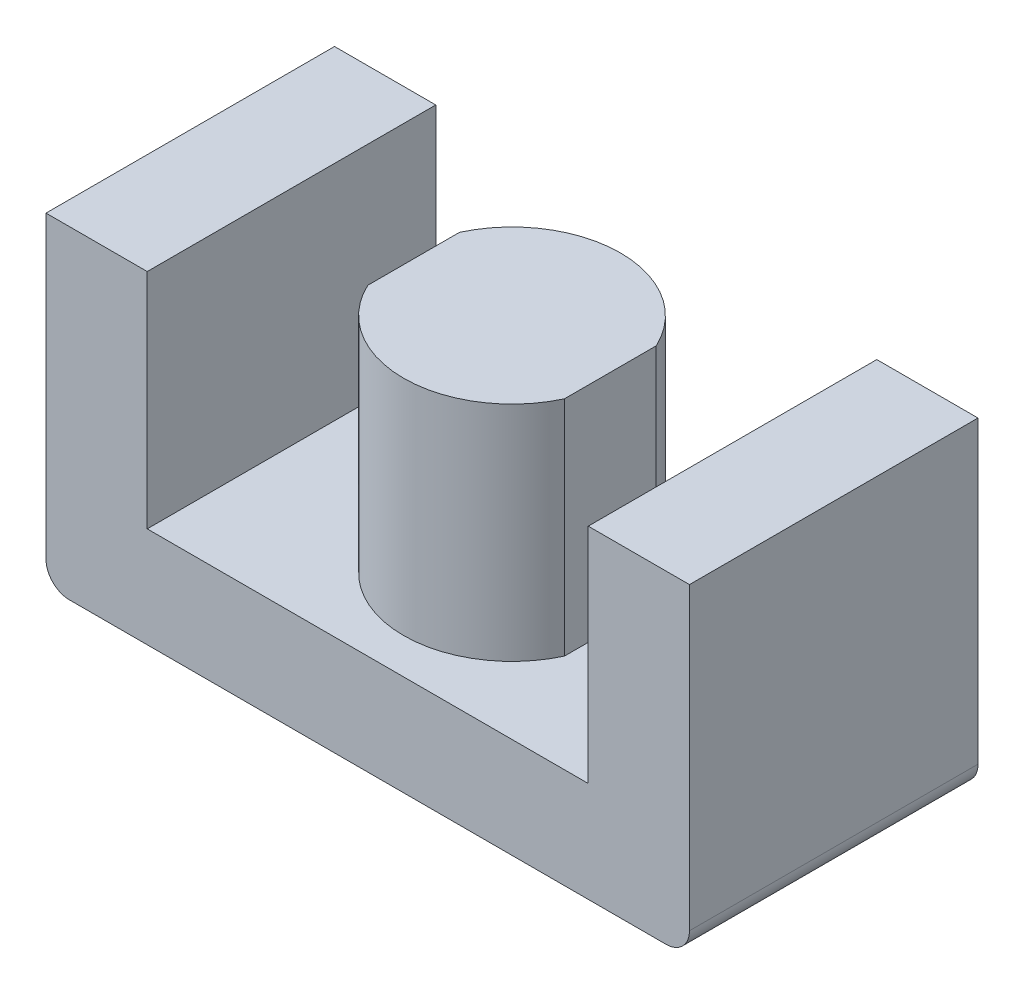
from build123d import *

# Parameters (mm, degrees)
SKETCH1_W           = 54.86
SKETCH1_H           = 24.6
BOSS_EXTRUDE1_DEPTH = 27.56
SKETCH2_W           = 37.6
SKETCH2_H           = 19
CUT_EXTRUDE1_DEPTH  = 47.012156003
SKETCH3_R           = 9.25
BOSS_EXTRUDE2_DEPTH = 19
FILLET1_R           = 2
SKETCH4_W           = 5
SKETCH4_H           = 30
CUT_EXTRUDE3_DEPTH  = 19


with BuildPart() as part:
    # Sketch1 → Boss-Extrude1 (new body)
    with BuildSketch(Plane(origin=(0, 0, 0), x_dir=(1, 0, 0), z_dir=(0, 1, 0))):
        Rectangle(SKETCH1_W, SKETCH1_H)
    extrude(amount=BOSS_EXTRUDE1_DEPTH)

    # Sketch2 → Cut-Extrude1 (cut, through all)
    with BuildSketch(Plane.XY.offset(12.3)):
        with Locations((0, 18.06)):
            Rectangle(SKETCH2_W, SKETCH2_H)
    extrude(amount=-CUT_EXTRUDE1_DEPTH, mode=Mode.SUBTRACT)

    # Sketch3 → Boss-Extrude2 (add)
    with BuildSketch(Plane(origin=(0, 8.56, 0), x_dir=(1, 0, 0), z_dir=(0, 1, 0))):
        Circle(SKETCH3_R)
    extrude(amount=BOSS_EXTRUDE2_DEPTH)

    # Fillet1
    fillet1_edges = [part.edges().sort_by_distance(p)[0] for p in [
        (-27.43, 0, 0),
        (27.43, 0, 0),
    ]]
    fillet(fillet1_edges, radius=FILLET1_R)

    # Sketch4 → Cut-Extrude3 (cut)
    with BuildSketch(Plane(origin=(0, 27.56, 0), x_dir=(1, 0, 0), z_dir=(0, 1, 0))):
        with Locations((-10.882, 0)):
            Rectangle(SKETCH4_W, SKETCH4_H)
        with Locations((10.882, 0)):
            Rectangle(SKETCH4_W, SKETCH4_H)
    extrude(amount=-CUT_EXTRUDE3_DEPTH, mode=Mode.SUBTRACT)


solid = part.part
